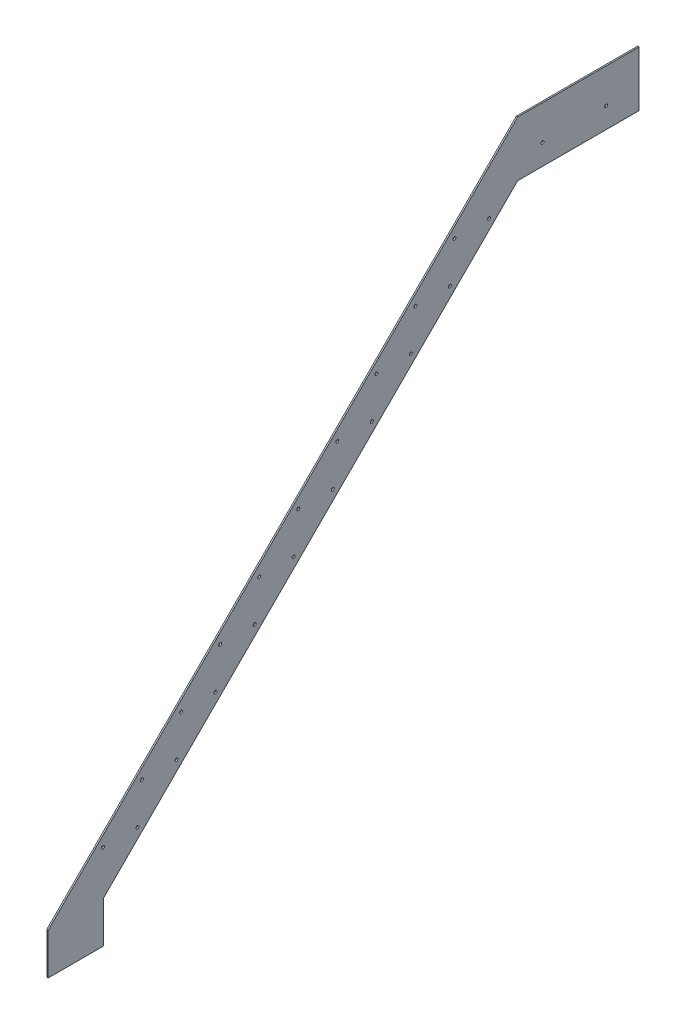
ISO-10303-21;
HEADER;
FILE_DESCRIPTION(('STEP AP214'),'2;1');
FILE_NAME('part.step','',(''),(''),'','','');
FILE_SCHEMA(('AUTOMOTIVE_DESIGN { 1 0 10303 214 1 1 1 1 }'));
ENDSEC;
DATA;
#1=APPLICATION_CONTEXT('core data for automotive mechanical design processes');
#2=APPLICATION_PROTOCOL_DEFINITION('international standard','automotive_design',2000,#1);
#3=PRODUCT_CONTEXT('',#1,'mechanical');
#4=PRODUCT('Part','Part','',(#3));
#5=PRODUCT_RELATED_PRODUCT_CATEGORY('part','',(#4));
#6=PRODUCT_DEFINITION_FORMATION('','',#4);
#7=PRODUCT_DEFINITION_CONTEXT('part definition',#1,'design');
#8=PRODUCT_DEFINITION('design','',#6,#7);
#9=PRODUCT_DEFINITION_SHAPE('','',#8);
#10=(LENGTH_UNIT() NAMED_UNIT(*) SI_UNIT(.MILLI.,.METRE.));
#11=(NAMED_UNIT(*) PLANE_ANGLE_UNIT() SI_UNIT($,.RADIAN.));
#12=(NAMED_UNIT(*) SI_UNIT($,.STERADIAN.) SOLID_ANGLE_UNIT());
#13=UNCERTAINTY_MEASURE_WITH_UNIT(LENGTH_MEASURE(1.E-05),#10,'distance_accuracy_value','');
#14=(GEOMETRIC_REPRESENTATION_CONTEXT(3) GLOBAL_UNCERTAINTY_ASSIGNED_CONTEXT((#13)) GLOBAL_UNIT_ASSIGNED_CONTEXT((#10,
#11,#12)) REPRESENTATION_CONTEXT('',''));
#15=CARTESIAN_POINT('',(0.,0.,0.));
#16=DIRECTION('',(0.,0.,1.));
#17=DIRECTION('',(1.,0.,0.));
#18=AXIS2_PLACEMENT_3D('',#15,#16,#17);
#19=CARTESIAN_POINT('',(0.,0.,0.));
#20=DIRECTION('',(-1.,0.,0.));
#21=DIRECTION('',(0.,0.,1.));
#22=AXIS2_PLACEMENT_3D('',#19,#20,#21);
#23=PLANE('',#22);
#24=CARTESIAN_POINT('',(0.,-1339.2135623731,1816.83920991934));
#25=DIRECTION('',(1.,0.,0.));
#26=DIRECTION('',(0.,0.,-1.));
#27=AXIS2_PLACEMENT_3D('',#24,#25,#26);
#28=CIRCLE('',#27,5.40000000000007);
#29=CARTESIAN_POINT('',(0.,-1339.2135623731,1811.43920991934));
#30=VERTEX_POINT('',#29);
#31=EDGE_CURVE('E287',#30,#30,#28,.T.);
#32=ORIENTED_EDGE('',*,*,#31,.F.);
#33=EDGE_LOOP('',(#32));
#34=FACE_BOUND('',#33,.T.);
#35=CARTESIAN_POINT('',(0.,-1197.79220613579,1675.41785368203));
#36=DIRECTION('',(1.,0.,0.));
#37=DIRECTION('',(0.,0.,-1.));
#38=AXIS2_PLACEMENT_3D('',#35,#36,#37);
#39=CIRCLE('',#38,5.40000000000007);
#40=CARTESIAN_POINT('',(0.,-1197.79220613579,1670.01785368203));
#41=VERTEX_POINT('',#40);
#42=EDGE_CURVE('E302',#41,#41,#39,.T.);
#43=ORIENTED_EDGE('',*,*,#42,.F.);
#44=EDGE_LOOP('',(#43));
#45=FACE_BOUND('',#44,.T.);
#46=CARTESIAN_POINT('',(0.,-1056.37084989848,1533.99649744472));
#47=DIRECTION('',(1.,0.,0.));
#48=DIRECTION('',(0.,0.,-1.));
#49=AXIS2_PLACEMENT_3D('',#46,#47,#48);
#50=CIRCLE('',#49,5.40000000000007);
#51=CARTESIAN_POINT('',(0.,-1056.37084989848,1528.59649744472));
#52=VERTEX_POINT('',#51);
#53=EDGE_CURVE('E314',#52,#52,#50,.T.);
#54=ORIENTED_EDGE('',*,*,#53,.F.);
#55=EDGE_LOOP('',(#54));
#56=FACE_BOUND('',#55,.T.);
#57=CARTESIAN_POINT('',(0.,-914.94949366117,1392.57514120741));
#58=DIRECTION('',(1.,0.,0.));
#59=DIRECTION('',(0.,0.,-1.));
#60=AXIS2_PLACEMENT_3D('',#57,#58,#59);
#61=CIRCLE('',#60,5.39999999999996);
#62=CARTESIAN_POINT('',(0.,-914.94949366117,1387.17514120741));
#63=VERTEX_POINT('',#62);
#64=EDGE_CURVE('E326',#63,#63,#61,.T.);
#65=ORIENTED_EDGE('',*,*,#64,.F.);
#66=EDGE_LOOP('',(#65));
#67=FACE_BOUND('',#66,.T.);
#68=CARTESIAN_POINT('',(0.,-773.52813742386,1251.1537849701));
#69=DIRECTION('',(1.,0.,0.));
#70=DIRECTION('',(0.,0.,-1.));
#71=AXIS2_PLACEMENT_3D('',#68,#69,#70);
#72=CIRCLE('',#71,5.39999999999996);
#73=CARTESIAN_POINT('',(0.,-773.52813742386,1245.7537849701));
#74=VERTEX_POINT('',#73);
#75=EDGE_CURVE('E338',#74,#74,#72,.T.);
#76=ORIENTED_EDGE('',*,*,#75,.F.);
#77=EDGE_LOOP('',(#76));
#78=FACE_BOUND('',#77,.T.);
#79=CARTESIAN_POINT('',(0.,-632.10678118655,1234.73242873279));
#80=DIRECTION('',(1.,0.,0.));
#81=DIRECTION('',(0.,0.,-1.));
#82=AXIS2_PLACEMENT_3D('',#79,#80,#81);
#83=CIRCLE('',#82,5.39999999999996);
#84=CARTESIAN_POINT('',(0.,-632.10678118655,1229.33242873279));
#85=VERTEX_POINT('',#84);
#86=EDGE_CURVE('E344',#85,#85,#83,.T.);
#87=ORIENTED_EDGE('',*,*,#86,.F.);
#88=EDGE_LOOP('',(#87));
#89=FACE_BOUND('',#88,.T.);
#90=CARTESIAN_POINT('',(0.,-490.68542494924,1093.31107249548));
#91=DIRECTION('',(1.,0.,0.));
#92=DIRECTION('',(0.,0.,-1.));
#93=AXIS2_PLACEMENT_3D('',#90,#91,#92);
#94=CIRCLE('',#93,5.39999999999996);
#95=CARTESIAN_POINT('',(0.,-490.68542494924,1087.91107249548));
#96=VERTEX_POINT('',#95);
#97=EDGE_CURVE('E356',#96,#96,#94,.T.);
#98=ORIENTED_EDGE('',*,*,#97,.F.);
#99=EDGE_LOOP('',(#98));
#100=FACE_BOUND('',#99,.T.);
#101=CARTESIAN_POINT('',(0.,-349.26406871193,951.889716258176));
#102=DIRECTION('',(1.,0.,0.));
#103=DIRECTION('',(0.,0.,-1.));
#104=AXIS2_PLACEMENT_3D('',#101,#102,#103);
#105=CIRCLE('',#104,5.40000000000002);
#106=CARTESIAN_POINT('',(0.,-349.26406871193,946.489716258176));
#107=VERTEX_POINT('',#106);
#108=EDGE_CURVE('E368',#107,#107,#105,.T.);
#109=ORIENTED_EDGE('',*,*,#108,.F.);
#110=EDGE_LOOP('',(#109));
#111=FACE_BOUND('',#110,.T.);
#112=CARTESIAN_POINT('',(0.,-207.84271247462,810.468360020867));
#113=DIRECTION('',(1.,0.,0.));
#114=DIRECTION('',(0.,0.,-1.));
#115=AXIS2_PLACEMENT_3D('',#112,#113,#114);
#116=CIRCLE('',#115,5.39999999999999);
#117=CARTESIAN_POINT('',(0.,-207.84271247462,805.068360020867));
#118=VERTEX_POINT('',#117);
#119=EDGE_CURVE('E380',#118,#118,#116,.T.);
#120=ORIENTED_EDGE('',*,*,#119,.F.);
#121=EDGE_LOOP('',(#120));
#122=FACE_BOUND('',#121,.T.);
#123=CARTESIAN_POINT('',(0.,-66.4213562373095,669.047003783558));
#124=DIRECTION('',(1.,0.,0.));
#125=DIRECTION('',(0.,0.,-1.));
#126=AXIS2_PLACEMENT_3D('',#123,#124,#125);
#127=CIRCLE('',#126,5.39999999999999);
#128=CARTESIAN_POINT('',(0.,-66.4213562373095,663.647003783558));
#129=VERTEX_POINT('',#128);
#130=EDGE_CURVE('E392',#129,#129,#127,.T.);
#131=ORIENTED_EDGE('',*,*,#130,.F.);
#132=EDGE_LOOP('',(#131));
#133=FACE_BOUND('',#132,.T.);
#134=DIRECTION('',(0.,1.,0.));
#135=VECTOR('',#134,1.);
#136=CARTESIAN_POINT('',(0.,200.,0.));
#137=LINE('',#136,#135);
#138=CARTESIAN_POINT('',(0.,0.,0.));
#139=VERTEX_POINT('',#138);
#140=CARTESIAN_POINT('',(0.,200.,0.));
#141=VERTEX_POINT('',#140);
#142=EDGE_CURVE('E139',#139,#141,#137,.T.);
#143=ORIENTED_EDGE('',*,*,#142,.T.);
#144=DIRECTION('',(0.,0.,1.));
#145=VECTOR('',#144,1.);
#146=CARTESIAN_POINT('',(0.,200.,440.12564754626));
#147=LINE('',#146,#145);
#148=CARTESIAN_POINT('',(0.,200.,440.12564754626));
#149=VERTEX_POINT('',#148);
#150=EDGE_CURVE('E142',#141,#149,#147,.T.);
#151=ORIENTED_EDGE('',*,*,#150,.T.);
#152=DIRECTION('',(0.,-0.70710678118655,0.707106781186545));
#153=VECTOR('',#152,1.);
#154=CARTESIAN_POINT('',(0.,-1500.,2140.12564754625));
#155=LINE('',#154,#153);
#156=CARTESIAN_POINT('',(0.,-1500.,2140.12564754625));
#157=VERTEX_POINT('',#156);
#158=EDGE_CURVE('E146',#149,#157,#155,.T.);
#159=ORIENTED_EDGE('',*,*,#158,.T.);
#160=DIRECTION('',(0.,-1.,0.));
#161=VECTOR('',#160,1.);
#162=CARTESIAN_POINT('',(0.,-1650.,2140.12564754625));
#163=LINE('',#162,#161);
#164=CARTESIAN_POINT('',(0.,-1650.,2140.12564754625));
#165=VERTEX_POINT('',#164);
#166=EDGE_CURVE('E149',#157,#165,#163,.T.);
#167=ORIENTED_EDGE('',*,*,#166,.T.);
#168=DIRECTION('',(0.,0.,-1.));
#169=VECTOR('',#168,1.);
#170=CARTESIAN_POINT('',(0.,-1650.,1940.12564754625));
#171=LINE('',#170,#169);
#172=CARTESIAN_POINT('',(0.,-1650.,1940.12564754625));
#173=VERTEX_POINT('',#172);
#174=EDGE_CURVE('E152',#165,#173,#171,.T.);
#175=ORIENTED_EDGE('',*,*,#174,.T.);
#176=DIRECTION('',(0.,1.,0.));
#177=VECTOR('',#176,1.);
#178=CARTESIAN_POINT('',(0.,-1500.,1940.12564754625));
#179=LINE('',#178,#177);
#180=CARTESIAN_POINT('',(0.,-1500.,1940.12564754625));
#181=VERTEX_POINT('',#180);
#182=EDGE_CURVE('E155',#173,#181,#179,.T.);
#183=ORIENTED_EDGE('',*,*,#182,.T.);
#184=DIRECTION('',(0.,0.70710678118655,-0.707106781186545));
#185=VECTOR('',#184,1.);
#186=CARTESIAN_POINT('',(0.,0.,440.12564754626));
#187=LINE('',#186,#185);
#188=CARTESIAN_POINT('',(0.,0.,440.12564754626));
#189=VERTEX_POINT('',#188);
#190=EDGE_CURVE('E116',#181,#189,#187,.T.);
#191=ORIENTED_EDGE('',*,*,#190,.T.);
#192=DIRECTION('',(0.,0.,-1.));
#193=VECTOR('',#192,1.);
#194=CARTESIAN_POINT('',(0.,0.,0.));
#195=LINE('',#194,#193);
#196=EDGE_CURVE('E158',#189,#139,#195,.T.);
#197=ORIENTED_EDGE('',*,*,#196,.T.);
#198=EDGE_LOOP('',(#143,#151,#159,#167,#175,#183,#191,#197));
#199=FACE_BOUND('',#198,.T.);
#200=CARTESIAN_POINT('',(0.,75.,350.));
#201=DIRECTION('',(1.,0.,0.));
#202=DIRECTION('',(0.,0.,-1.));
#203=AXIS2_PLACEMENT_3D('',#200,#201,#202);
#204=CIRCLE('',#203,5.39999999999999);
#205=CARTESIAN_POINT('',(0.,75.,344.6));
#206=VERTEX_POINT('',#205);
#207=EDGE_CURVE('E410',#206,#206,#204,.T.);
#208=ORIENTED_EDGE('',*,*,#207,.F.);
#209=EDGE_LOOP('',(#208));
#210=FACE_BOUND('',#209,.T.);
#211=CARTESIAN_POINT('',(0.,75.,120.));
#212=DIRECTION('',(1.,0.,0.));
#213=DIRECTION('',(0.,0.,-1.));
#214=AXIS2_PLACEMENT_3D('',#211,#212,#213);
#215=CIRCLE('',#214,5.39999999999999);
#216=CARTESIAN_POINT('',(0.,75.,114.6));
#217=VERTEX_POINT('',#216);
#218=EDGE_CURVE('E404',#217,#217,#215,.T.);
#219=ORIENTED_EDGE('',*,*,#218,.F.);
#220=EDGE_LOOP('',(#219));
#221=FACE_BOUND('',#220,.T.);
#222=CARTESIAN_POINT('',(0.,-66.4213562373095,544.047003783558));
#223=DIRECTION('',(1.,0.,0.));
#224=DIRECTION('',(0.,0.,-1.));
#225=AXIS2_PLACEMENT_3D('',#222,#223,#224);
#226=CIRCLE('',#225,5.39999999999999);
#227=CARTESIAN_POINT('',(0.,-66.4213562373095,538.647003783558));
#228=VERTEX_POINT('',#227);
#229=EDGE_CURVE('E398',#228,#228,#226,.T.);
#230=ORIENTED_EDGE('',*,*,#229,.F.);
#231=EDGE_LOOP('',(#230));
#232=FACE_BOUND('',#231,.T.);
#233=CARTESIAN_POINT('',(0.,-207.84271247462,685.468360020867));
#234=DIRECTION('',(1.,0.,0.));
#235=DIRECTION('',(0.,0.,-1.));
#236=AXIS2_PLACEMENT_3D('',#233,#234,#235);
#237=CIRCLE('',#236,5.39999999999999);
#238=CARTESIAN_POINT('',(0.,-207.84271247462,680.068360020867));
#239=VERTEX_POINT('',#238);
#240=EDGE_CURVE('E386',#239,#239,#237,.T.);
#241=ORIENTED_EDGE('',*,*,#240,.F.);
#242=EDGE_LOOP('',(#241));
#243=FACE_BOUND('',#242,.T.);
#244=CARTESIAN_POINT('',(0.,-349.264068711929,826.889716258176));
#245=DIRECTION('',(1.,0.,0.));
#246=DIRECTION('',(0.,0.,-1.));
#247=AXIS2_PLACEMENT_3D('',#244,#245,#246);
#248=CIRCLE('',#247,5.39999999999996);
#249=CARTESIAN_POINT('',(0.,-349.264068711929,821.489716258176));
#250=VERTEX_POINT('',#249);
#251=EDGE_CURVE('E374',#250,#250,#248,.T.);
#252=ORIENTED_EDGE('',*,*,#251,.F.);
#253=EDGE_LOOP('',(#252));
#254=FACE_BOUND('',#253,.T.);
#255=CARTESIAN_POINT('',(0.,-490.68542494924,968.311072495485));
#256=DIRECTION('',(1.,0.,0.));
#257=DIRECTION('',(0.,0.,-1.));
#258=AXIS2_PLACEMENT_3D('',#255,#256,#257);
#259=CIRCLE('',#258,5.39999999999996);
#260=CARTESIAN_POINT('',(0.,-490.68542494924,962.911072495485));
#261=VERTEX_POINT('',#260);
#262=EDGE_CURVE('E362',#261,#261,#259,.T.);
#263=ORIENTED_EDGE('',*,*,#262,.F.);
#264=EDGE_LOOP('',(#263));
#265=FACE_BOUND('',#264,.T.);
#266=CARTESIAN_POINT('',(0.,-632.10678118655,1109.73242873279));
#267=DIRECTION('',(1.,0.,0.));
#268=DIRECTION('',(0.,0.,-1.));
#269=AXIS2_PLACEMENT_3D('',#266,#267,#268);
#270=CIRCLE('',#269,5.39999999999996);
#271=CARTESIAN_POINT('',(0.,-632.10678118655,1104.33242873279));
#272=VERTEX_POINT('',#271);
#273=EDGE_CURVE('E350',#272,#272,#270,.T.);
#274=ORIENTED_EDGE('',*,*,#273,.F.);
#275=EDGE_LOOP('',(#274));
#276=FACE_BOUND('',#275,.T.);
#277=CARTESIAN_POINT('',(0.,-773.52813742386,1376.1537849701));
#278=DIRECTION('',(1.,0.,0.));
#279=DIRECTION('',(0.,0.,-1.));
#280=AXIS2_PLACEMENT_3D('',#277,#278,#279);
#281=CIRCLE('',#280,5.39999999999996);
#282=CARTESIAN_POINT('',(0.,-773.52813742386,1370.7537849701));
#283=VERTEX_POINT('',#282);
#284=EDGE_CURVE('E332',#283,#283,#281,.T.);
#285=ORIENTED_EDGE('',*,*,#284,.F.);
#286=EDGE_LOOP('',(#285));
#287=FACE_BOUND('',#286,.T.);
#288=CARTESIAN_POINT('',(0.,-914.94949366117,1517.57514120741));
#289=DIRECTION('',(1.,0.,0.));
#290=DIRECTION('',(0.,0.,-1.));
#291=AXIS2_PLACEMENT_3D('',#288,#289,#290);
#292=CIRCLE('',#291,5.39999999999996);
#293=CARTESIAN_POINT('',(0.,-914.94949366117,1512.17514120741));
#294=VERTEX_POINT('',#293);
#295=EDGE_CURVE('E320',#294,#294,#292,.T.);
#296=ORIENTED_EDGE('',*,*,#295,.F.);
#297=EDGE_LOOP('',(#296));
#298=FACE_BOUND('',#297,.T.);
#299=CARTESIAN_POINT('',(0.,-1056.37084989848,1658.99649744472));
#300=DIRECTION('',(1.,0.,0.));
#301=DIRECTION('',(0.,0.,-1.));
#302=AXIS2_PLACEMENT_3D('',#299,#300,#301);
#303=CIRCLE('',#302,5.40000000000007);
#304=CARTESIAN_POINT('',(0.,-1056.37084989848,1653.59649744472));
#305=VERTEX_POINT('',#304);
#306=EDGE_CURVE('E308',#305,#305,#303,.T.);
#307=ORIENTED_EDGE('',*,*,#306,.F.);
#308=EDGE_LOOP('',(#307));
#309=FACE_BOUND('',#308,.T.);
#310=CARTESIAN_POINT('',(0.,-1197.79220613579,1800.41785368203));
#311=DIRECTION('',(1.,0.,0.));
#312=DIRECTION('',(0.,0.,-1.));
#313=AXIS2_PLACEMENT_3D('',#310,#311,#312);
#314=CIRCLE('',#313,5.40000000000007);
#315=CARTESIAN_POINT('',(0.,-1197.79220613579,1795.01785368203));
#316=VERTEX_POINT('',#315);
#317=EDGE_CURVE('E296',#316,#316,#314,.T.);
#318=ORIENTED_EDGE('',*,*,#317,.F.);
#319=EDGE_LOOP('',(#318));
#320=FACE_BOUND('',#319,.T.);
#321=CARTESIAN_POINT('',(0.,-1339.2135623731,1941.83920991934));
#322=DIRECTION('',(1.,0.,0.));
#323=DIRECTION('',(0.,0.,-1.));
#324=AXIS2_PLACEMENT_3D('',#321,#322,#323);
#325=CIRCLE('',#324,5.40000000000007);
#326=CARTESIAN_POINT('',(0.,-1339.2135623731,1936.43920991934));
#327=VERTEX_POINT('',#326);
#328=EDGE_CURVE('E283',#327,#327,#325,.T.);
#329=ORIENTED_EDGE('',*,*,#328,.F.);
#330=EDGE_LOOP('',(#329));
#331=FACE_BOUND('',#330,.T.);
#332=ADVANCED_FACE('F41',(#34,#45,#56,#67,#78,#89,#100,#111,#122,#133,#199,#210,#221,#232,#243,
#254,#265,#276,#287,#298,#309,#320,#331),#23,.F.);
#333=CARTESIAN_POINT('',(-5.,200.,0.));
#334=DIRECTION('',(0.,0.,-1.));
#335=DIRECTION('',(-1.,0.,0.));
#336=AXIS2_PLACEMENT_3D('',#333,#334,#335);
#337=PLANE('',#336);
#338=ORIENTED_EDGE('',*,*,#142,.F.);
#339=DIRECTION('',(1.,0.,0.));
#340=VECTOR('',#339,1.);
#341=CARTESIAN_POINT('',(-5.,0.,0.));
#342=LINE('',#341,#340);
#343=CARTESIAN_POINT('',(-5.,0.,0.));
#344=VERTEX_POINT('',#343);
#345=EDGE_CURVE('E11',#344,#139,#342,.T.);
#346=ORIENTED_EDGE('',*,*,#345,.F.);
#347=DIRECTION('',(0.,1.,0.));
#348=VECTOR('',#347,1.);
#349=CARTESIAN_POINT('',(-5.,200.,0.));
#350=LINE('',#349,#348);
#351=CARTESIAN_POINT('',(-5.,200.,0.));
#352=VERTEX_POINT('',#351);
#353=EDGE_CURVE('E160',#344,#352,#350,.T.);
#354=ORIENTED_EDGE('',*,*,#353,.T.);
#355=DIRECTION('',(1.,0.,0.));
#356=VECTOR('',#355,1.);
#357=CARTESIAN_POINT('',(-5.,200.,0.));
#358=LINE('',#357,#356);
#359=EDGE_CURVE('E45',#352,#141,#358,.T.);
#360=ORIENTED_EDGE('',*,*,#359,.T.);
#361=EDGE_LOOP('',(#338,#346,#354,#360));
#362=FACE_BOUND('',#361,.T.);
#363=ADVANCED_FACE('F43',(#362),#337,.T.);
#364=CARTESIAN_POINT('',(-5.,0.,0.));
#365=DIRECTION('',(0.,-1.,0.));
#366=DIRECTION('',(0.,0.,-1.));
#367=AXIS2_PLACEMENT_3D('',#364,#365,#366);
#368=PLANE('',#367);
#369=ORIENTED_EDGE('',*,*,#196,.F.);
#370=DIRECTION('',(1.,0.,0.));
#371=VECTOR('',#370,1.);
#372=CARTESIAN_POINT('',(-5.,0.,440.12564754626));
#373=LINE('',#372,#371);
#374=CARTESIAN_POINT('',(-5.,0.,440.12564754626));
#375=VERTEX_POINT('',#374);
#376=EDGE_CURVE('E51',#375,#189,#373,.T.);
#377=ORIENTED_EDGE('',*,*,#376,.F.);
#378=DIRECTION('',(0.,0.,-1.));
#379=VECTOR('',#378,1.);
#380=CARTESIAN_POINT('',(-5.,0.,0.));
#381=LINE('',#380,#379);
#382=EDGE_CURVE('E129',#375,#344,#381,.T.);
#383=ORIENTED_EDGE('',*,*,#382,.T.);
#384=ORIENTED_EDGE('',*,*,#345,.T.);
#385=EDGE_LOOP('',(#369,#377,#383,#384));
#386=FACE_BOUND('',#385,.T.);
#387=ADVANCED_FACE('F172',(#386),#368,.T.);
#388=CARTESIAN_POINT('',(-5.,0.,440.12564754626));
#389=DIRECTION('',(0.,-0.707106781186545,-0.70710678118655));
#390=DIRECTION('',(0.,0.70710678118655,-0.707106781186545));
#391=AXIS2_PLACEMENT_3D('',#388,#389,#390);
#392=PLANE('',#391);
#393=ORIENTED_EDGE('',*,*,#190,.F.);
#394=DIRECTION('',(1.,0.,0.));
#395=VECTOR('',#394,1.);
#396=CARTESIAN_POINT('',(-5.,-1500.,1940.12564754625));
#397=LINE('',#396,#395);
#398=CARTESIAN_POINT('',(-5.,-1500.,1940.12564754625));
#399=VERTEX_POINT('',#398);
#400=EDGE_CURVE('E111',#399,#181,#397,.T.);
#401=ORIENTED_EDGE('',*,*,#400,.F.);
#402=DIRECTION('',(0.,0.70710678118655,-0.707106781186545));
#403=VECTOR('',#402,1.);
#404=CARTESIAN_POINT('',(-5.,0.,440.12564754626));
#405=LINE('',#404,#403);
#406=EDGE_CURVE('E114',#399,#375,#405,.T.);
#407=ORIENTED_EDGE('',*,*,#406,.T.);
#408=ORIENTED_EDGE('',*,*,#376,.T.);
#409=EDGE_LOOP('',(#393,#401,#407,#408));
#410=FACE_BOUND('',#409,.T.);
#411=ADVANCED_FACE('F113',(#410),#392,.T.);
#412=CARTESIAN_POINT('',(-5.,-1500.,1940.12564754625));
#413=DIRECTION('',(0.,0.,-1.));
#414=DIRECTION('',(0.,1.,0.));
#415=AXIS2_PLACEMENT_3D('',#412,#413,#414);
#416=PLANE('',#415);
#417=ORIENTED_EDGE('',*,*,#182,.F.);
#418=DIRECTION('',(1.,0.,0.));
#419=VECTOR('',#418,1.);
#420=CARTESIAN_POINT('',(-5.,-1650.,1940.12564754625));
#421=LINE('',#420,#419);
#422=CARTESIAN_POINT('',(-5.,-1650.,1940.12564754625));
#423=VERTEX_POINT('',#422);
#424=EDGE_CURVE('E121',#423,#173,#421,.T.);
#425=ORIENTED_EDGE('',*,*,#424,.F.);
#426=DIRECTION('',(0.,1.,0.));
#427=VECTOR('',#426,1.);
#428=CARTESIAN_POINT('',(-5.,-1500.,1940.12564754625));
#429=LINE('',#428,#427);
#430=EDGE_CURVE('E127',#423,#399,#429,.T.);
#431=ORIENTED_EDGE('',*,*,#430,.T.);
#432=ORIENTED_EDGE('',*,*,#400,.T.);
#433=EDGE_LOOP('',(#417,#425,#431,#432));
#434=FACE_BOUND('',#433,.T.);
#435=ADVANCED_FACE('F131',(#434),#416,.T.);
#436=CARTESIAN_POINT('',(-5.,-1650.,1940.12564754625));
#437=DIRECTION('',(0.,-1.,0.));
#438=DIRECTION('',(0.,0.,-1.));
#439=AXIS2_PLACEMENT_3D('',#436,#437,#438);
#440=PLANE('',#439);
#441=ORIENTED_EDGE('',*,*,#174,.F.);
#442=DIRECTION('',(1.,0.,0.));
#443=VECTOR('',#442,1.);
#444=CARTESIAN_POINT('',(-5.,-1650.,2140.12564754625));
#445=LINE('',#444,#443);
#446=CARTESIAN_POINT('',(-5.,-1650.,2140.12564754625));
#447=VERTEX_POINT('',#446);
#448=EDGE_CURVE('E164',#447,#165,#445,.T.);
#449=ORIENTED_EDGE('',*,*,#448,.F.);
#450=DIRECTION('',(0.,0.,-1.));
#451=VECTOR('',#450,1.);
#452=CARTESIAN_POINT('',(-5.,-1650.,1940.12564754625));
#453=LINE('',#452,#451);
#454=EDGE_CURVE('E132',#447,#423,#453,.T.);
#455=ORIENTED_EDGE('',*,*,#454,.T.);
#456=ORIENTED_EDGE('',*,*,#424,.T.);
#457=EDGE_LOOP('',(#441,#449,#455,#456));
#458=FACE_BOUND('',#457,.T.);
#459=ADVANCED_FACE('F430',(#458),#440,.T.);
#460=CARTESIAN_POINT('',(-5.,-1650.,2140.12564754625));
#461=DIRECTION('',(0.,0.,1.));
#462=DIRECTION('',(0.,-1.,0.));
#463=AXIS2_PLACEMENT_3D('',#460,#461,#462);
#464=PLANE('',#463);
#465=ORIENTED_EDGE('',*,*,#166,.F.);
#466=DIRECTION('',(1.,0.,0.));
#467=VECTOR('',#466,1.);
#468=CARTESIAN_POINT('',(-5.,-1500.,2140.12564754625));
#469=LINE('',#468,#467);
#470=CARTESIAN_POINT('',(-5.,-1500.,2140.12564754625));
#471=VERTEX_POINT('',#470);
#472=EDGE_CURVE('E166',#471,#157,#469,.T.);
#473=ORIENTED_EDGE('',*,*,#472,.F.);
#474=DIRECTION('',(0.,-1.,0.));
#475=VECTOR('',#474,1.);
#476=CARTESIAN_POINT('',(-5.,-1650.,2140.12564754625));
#477=LINE('',#476,#475);
#478=EDGE_CURVE('E134',#471,#447,#477,.T.);
#479=ORIENTED_EDGE('',*,*,#478,.T.);
#480=ORIENTED_EDGE('',*,*,#448,.T.);
#481=EDGE_LOOP('',(#465,#473,#479,#480));
#482=FACE_BOUND('',#481,.T.);
#483=ADVANCED_FACE('F424',(#482),#464,.T.);
#484=CARTESIAN_POINT('',(-5.,-1500.,2140.12564754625));
#485=DIRECTION('',(0.,0.707106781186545,0.70710678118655));
#486=DIRECTION('',(0.,-0.70710678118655,0.707106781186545));
#487=AXIS2_PLACEMENT_3D('',#484,#485,#486);
#488=PLANE('',#487);
#489=ORIENTED_EDGE('',*,*,#158,.F.);
#490=DIRECTION('',(1.,0.,0.));
#491=VECTOR('',#490,1.);
#492=CARTESIAN_POINT('',(-5.,200.,440.12564754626));
#493=LINE('',#492,#491);
#494=CARTESIAN_POINT('',(-5.,200.,440.12564754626));
#495=VERTEX_POINT('',#494);
#496=EDGE_CURVE('E167',#495,#149,#493,.T.);
#497=ORIENTED_EDGE('',*,*,#496,.F.);
#498=DIRECTION('',(0.,-0.70710678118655,0.707106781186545));
#499=VECTOR('',#498,1.);
#500=CARTESIAN_POINT('',(-5.,-1500.,2140.12564754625));
#501=LINE('',#500,#499);
#502=EDGE_CURVE('E418',#495,#471,#501,.T.);
#503=ORIENTED_EDGE('',*,*,#502,.T.);
#504=ORIENTED_EDGE('',*,*,#472,.T.);
#505=EDGE_LOOP('',(#489,#497,#503,#504));
#506=FACE_BOUND('',#505,.T.);
#507=ADVANCED_FACE('F428',(#506),#488,.T.);
#508=CARTESIAN_POINT('',(-5.,200.,440.12564754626));
#509=DIRECTION('',(0.,1.,0.));
#510=DIRECTION('',(0.,0.,1.));
#511=AXIS2_PLACEMENT_3D('',#508,#509,#510);
#512=PLANE('',#511);
#513=ORIENTED_EDGE('',*,*,#150,.F.);
#514=ORIENTED_EDGE('',*,*,#359,.F.);
#515=DIRECTION('',(0.,0.,1.));
#516=VECTOR('',#515,1.);
#517=CARTESIAN_POINT('',(-5.,200.,440.12564754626));
#518=LINE('',#517,#516);
#519=EDGE_CURVE('E416',#352,#495,#518,.T.);
#520=ORIENTED_EDGE('',*,*,#519,.T.);
#521=ORIENTED_EDGE('',*,*,#496,.T.);
#522=EDGE_LOOP('',(#513,#514,#520,#521));
#523=FACE_BOUND('',#522,.T.);
#524=ADVANCED_FACE('F169',(#523),#512,.T.);
#525=CARTESIAN_POINT('',(-5.,0.,0.));
#526=DIRECTION('',(-1.,0.,0.));
#527=DIRECTION('',(0.,0.,1.));
#528=AXIS2_PLACEMENT_3D('',#525,#526,#527);
#529=PLANE('',#528);
#530=CARTESIAN_POINT('',(-5.,-1339.2135623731,1941.83920991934));
#531=DIRECTION('',(-1.,0.,0.));
#532=DIRECTION('',(0.,0.,1.));
#533=AXIS2_PLACEMENT_3D('',#530,#531,#532);
#534=CIRCLE('',#533,5.40000000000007);
#535=CARTESIAN_POINT('',(-5.,-1339.2135623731,1947.23920991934));
#536=VERTEX_POINT('',#535);
#537=EDGE_CURVE('E286',#536,#536,#534,.T.);
#538=ORIENTED_EDGE('',*,*,#537,.F.);
#539=EDGE_LOOP('',(#538));
#540=FACE_BOUND('',#539,.T.);
#541=CARTESIAN_POINT('',(-5.,-1339.2135623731,1816.83920991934));
#542=DIRECTION('',(-1.,0.,0.));
#543=DIRECTION('',(0.,0.,1.));
#544=AXIS2_PLACEMENT_3D('',#541,#542,#543);
#545=CIRCLE('',#544,5.40000000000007);
#546=CARTESIAN_POINT('',(-5.,-1339.2135623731,1822.23920991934));
#547=VERTEX_POINT('',#546);
#548=EDGE_CURVE('E290',#547,#547,#545,.T.);
#549=ORIENTED_EDGE('',*,*,#548,.F.);
#550=EDGE_LOOP('',(#549));
#551=FACE_BOUND('',#550,.T.);
#552=CARTESIAN_POINT('',(-5.,-1197.79220613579,1800.41785368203));
#553=DIRECTION('',(-1.,0.,0.));
#554=DIRECTION('',(0.,0.,1.));
#555=AXIS2_PLACEMENT_3D('',#552,#553,#554);
#556=CIRCLE('',#555,5.40000000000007);
#557=CARTESIAN_POINT('',(-5.,-1197.79220613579,1805.81785368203));
#558=VERTEX_POINT('',#557);
#559=EDGE_CURVE('E299',#558,#558,#556,.T.);
#560=ORIENTED_EDGE('',*,*,#559,.F.);
#561=EDGE_LOOP('',(#560));
#562=FACE_BOUND('',#561,.T.);
#563=CARTESIAN_POINT('',(-5.,-1197.79220613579,1675.41785368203));
#564=DIRECTION('',(-1.,0.,0.));
#565=DIRECTION('',(0.,0.,1.));
#566=AXIS2_PLACEMENT_3D('',#563,#564,#565);
#567=CIRCLE('',#566,5.40000000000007);
#568=CARTESIAN_POINT('',(-5.,-1197.79220613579,1680.81785368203));
#569=VERTEX_POINT('',#568);
#570=EDGE_CURVE('E305',#569,#569,#567,.T.);
#571=ORIENTED_EDGE('',*,*,#570,.F.);
#572=EDGE_LOOP('',(#571));
#573=FACE_BOUND('',#572,.T.);
#574=CARTESIAN_POINT('',(-5.,-1056.37084989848,1658.99649744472));
#575=DIRECTION('',(-1.,0.,0.));
#576=DIRECTION('',(0.,0.,1.));
#577=AXIS2_PLACEMENT_3D('',#574,#575,#576);
#578=CIRCLE('',#577,5.40000000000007);
#579=CARTESIAN_POINT('',(-5.,-1056.37084989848,1664.39649744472));
#580=VERTEX_POINT('',#579);
#581=EDGE_CURVE('E311',#580,#580,#578,.T.);
#582=ORIENTED_EDGE('',*,*,#581,.F.);
#583=EDGE_LOOP('',(#582));
#584=FACE_BOUND('',#583,.T.);
#585=CARTESIAN_POINT('',(-5.,-1056.37084989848,1533.99649744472));
#586=DIRECTION('',(-1.,0.,0.));
#587=DIRECTION('',(0.,0.,1.));
#588=AXIS2_PLACEMENT_3D('',#585,#586,#587);
#589=CIRCLE('',#588,5.40000000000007);
#590=CARTESIAN_POINT('',(-5.,-1056.37084989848,1539.39649744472));
#591=VERTEX_POINT('',#590);
#592=EDGE_CURVE('E317',#591,#591,#589,.T.);
#593=ORIENTED_EDGE('',*,*,#592,.F.);
#594=EDGE_LOOP('',(#593));
#595=FACE_BOUND('',#594,.T.);
#596=CARTESIAN_POINT('',(-5.,-914.94949366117,1517.57514120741));
#597=DIRECTION('',(-1.,0.,0.));
#598=DIRECTION('',(0.,0.,1.));
#599=AXIS2_PLACEMENT_3D('',#596,#597,#598);
#600=CIRCLE('',#599,5.39999999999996);
#601=CARTESIAN_POINT('',(-5.,-914.94949366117,1522.97514120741));
#602=VERTEX_POINT('',#601);
#603=EDGE_CURVE('E323',#602,#602,#600,.T.);
#604=ORIENTED_EDGE('',*,*,#603,.F.);
#605=EDGE_LOOP('',(#604));
#606=FACE_BOUND('',#605,.T.);
#607=CARTESIAN_POINT('',(-5.,-914.94949366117,1392.57514120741));
#608=DIRECTION('',(-1.,0.,0.));
#609=DIRECTION('',(0.,0.,1.));
#610=AXIS2_PLACEMENT_3D('',#607,#608,#609);
#611=CIRCLE('',#610,5.39999999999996);
#612=CARTESIAN_POINT('',(-5.,-914.94949366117,1397.97514120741));
#613=VERTEX_POINT('',#612);
#614=EDGE_CURVE('E329',#613,#613,#611,.T.);
#615=ORIENTED_EDGE('',*,*,#614,.F.);
#616=EDGE_LOOP('',(#615));
#617=FACE_BOUND('',#616,.T.);
#618=CARTESIAN_POINT('',(-5.,-773.52813742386,1376.1537849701));
#619=DIRECTION('',(-1.,0.,0.));
#620=DIRECTION('',(0.,0.,1.));
#621=AXIS2_PLACEMENT_3D('',#618,#619,#620);
#622=CIRCLE('',#621,5.39999999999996);
#623=CARTESIAN_POINT('',(-5.,-773.52813742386,1381.5537849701));
#624=VERTEX_POINT('',#623);
#625=EDGE_CURVE('E335',#624,#624,#622,.T.);
#626=ORIENTED_EDGE('',*,*,#625,.F.);
#627=EDGE_LOOP('',(#626));
#628=FACE_BOUND('',#627,.T.);
#629=CARTESIAN_POINT('',(-5.,-773.52813742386,1251.1537849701));
#630=DIRECTION('',(-1.,0.,0.));
#631=DIRECTION('',(0.,0.,1.));
#632=AXIS2_PLACEMENT_3D('',#629,#630,#631);
#633=CIRCLE('',#632,5.39999999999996);
#634=CARTESIAN_POINT('',(-5.,-773.52813742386,1256.5537849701));
#635=VERTEX_POINT('',#634);
#636=EDGE_CURVE('E341',#635,#635,#633,.T.);
#637=ORIENTED_EDGE('',*,*,#636,.F.);
#638=EDGE_LOOP('',(#637));
#639=FACE_BOUND('',#638,.T.);
#640=CARTESIAN_POINT('',(-5.,-632.10678118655,1234.73242873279));
#641=DIRECTION('',(-1.,0.,0.));
#642=DIRECTION('',(0.,0.,1.));
#643=AXIS2_PLACEMENT_3D('',#640,#641,#642);
#644=CIRCLE('',#643,5.39999999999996);
#645=CARTESIAN_POINT('',(-5.,-632.10678118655,1240.13242873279));
#646=VERTEX_POINT('',#645);
#647=EDGE_CURVE('E347',#646,#646,#644,.T.);
#648=ORIENTED_EDGE('',*,*,#647,.F.);
#649=EDGE_LOOP('',(#648));
#650=FACE_BOUND('',#649,.T.);
#651=CARTESIAN_POINT('',(-5.,-632.10678118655,1109.73242873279));
#652=DIRECTION('',(-1.,0.,0.));
#653=DIRECTION('',(0.,0.,1.));
#654=AXIS2_PLACEMENT_3D('',#651,#652,#653);
#655=CIRCLE('',#654,5.39999999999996);
#656=CARTESIAN_POINT('',(-5.,-632.10678118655,1115.13242873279));
#657=VERTEX_POINT('',#656);
#658=EDGE_CURVE('E353',#657,#657,#655,.T.);
#659=ORIENTED_EDGE('',*,*,#658,.F.);
#660=EDGE_LOOP('',(#659));
#661=FACE_BOUND('',#660,.T.);
#662=CARTESIAN_POINT('',(-5.,-490.68542494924,1093.31107249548));
#663=DIRECTION('',(-1.,0.,0.));
#664=DIRECTION('',(0.,0.,1.));
#665=AXIS2_PLACEMENT_3D('',#662,#663,#664);
#666=CIRCLE('',#665,5.39999999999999);
#667=CARTESIAN_POINT('',(-5.,-490.68542494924,1098.71107249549));
#668=VERTEX_POINT('',#667);
#669=EDGE_CURVE('E359',#668,#668,#666,.T.);
#670=ORIENTED_EDGE('',*,*,#669,.F.);
#671=EDGE_LOOP('',(#670));
#672=FACE_BOUND('',#671,.T.);
#673=CARTESIAN_POINT('',(-5.,-490.68542494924,968.311072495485));
#674=DIRECTION('',(-1.,0.,0.));
#675=DIRECTION('',(0.,0.,1.));
#676=AXIS2_PLACEMENT_3D('',#673,#674,#675);
#677=CIRCLE('',#676,5.39999999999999);
#678=CARTESIAN_POINT('',(-5.,-490.68542494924,973.711072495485));
#679=VERTEX_POINT('',#678);
#680=EDGE_CURVE('E365',#679,#679,#677,.T.);
#681=ORIENTED_EDGE('',*,*,#680,.F.);
#682=EDGE_LOOP('',(#681));
#683=FACE_BOUND('',#682,.T.);
#684=CARTESIAN_POINT('',(-5.,-349.26406871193,951.889716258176));
#685=DIRECTION('',(-1.,0.,0.));
#686=DIRECTION('',(0.,0.,1.));
#687=AXIS2_PLACEMENT_3D('',#684,#685,#686);
#688=CIRCLE('',#687,5.40000000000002);
#689=CARTESIAN_POINT('',(-5.,-349.26406871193,957.289716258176));
#690=VERTEX_POINT('',#689);
#691=EDGE_CURVE('E371',#690,#690,#688,.T.);
#692=ORIENTED_EDGE('',*,*,#691,.F.);
#693=EDGE_LOOP('',(#692));
#694=FACE_BOUND('',#693,.T.);
#695=CARTESIAN_POINT('',(-5.,-349.264068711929,826.889716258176));
#696=DIRECTION('',(-1.,0.,0.));
#697=DIRECTION('',(0.,0.,1.));
#698=AXIS2_PLACEMENT_3D('',#695,#696,#697);
#699=CIRCLE('',#698,5.39999999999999);
#700=CARTESIAN_POINT('',(-5.,-349.264068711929,832.289716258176));
#701=VERTEX_POINT('',#700);
#702=EDGE_CURVE('E377',#701,#701,#699,.T.);
#703=ORIENTED_EDGE('',*,*,#702,.F.);
#704=EDGE_LOOP('',(#703));
#705=FACE_BOUND('',#704,.T.);
#706=CARTESIAN_POINT('',(-5.,-207.84271247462,810.468360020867));
#707=DIRECTION('',(-1.,0.,0.));
#708=DIRECTION('',(0.,0.,1.));
#709=AXIS2_PLACEMENT_3D('',#706,#707,#708);
#710=CIRCLE('',#709,5.39999999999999);
#711=CARTESIAN_POINT('',(-5.,-207.84271247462,815.868360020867));
#712=VERTEX_POINT('',#711);
#713=EDGE_CURVE('E383',#712,#712,#710,.T.);
#714=ORIENTED_EDGE('',*,*,#713,.F.);
#715=EDGE_LOOP('',(#714));
#716=FACE_BOUND('',#715,.T.);
#717=CARTESIAN_POINT('',(-5.,-207.84271247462,685.468360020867));
#718=DIRECTION('',(-1.,0.,0.));
#719=DIRECTION('',(0.,0.,1.));
#720=AXIS2_PLACEMENT_3D('',#717,#718,#719);
#721=CIRCLE('',#720,5.39999999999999);
#722=CARTESIAN_POINT('',(-5.,-207.84271247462,690.868360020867));
#723=VERTEX_POINT('',#722);
#724=EDGE_CURVE('E389',#723,#723,#721,.T.);
#725=ORIENTED_EDGE('',*,*,#724,.F.);
#726=EDGE_LOOP('',(#725));
#727=FACE_BOUND('',#726,.T.);
#728=CARTESIAN_POINT('',(-5.,-66.4213562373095,669.047003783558));
#729=DIRECTION('',(-1.,0.,0.));
#730=DIRECTION('',(0.,0.,1.));
#731=AXIS2_PLACEMENT_3D('',#728,#729,#730);
#732=CIRCLE('',#731,5.4);
#733=CARTESIAN_POINT('',(-5.,-66.4213562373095,674.447003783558));
#734=VERTEX_POINT('',#733);
#735=EDGE_CURVE('E395',#734,#734,#732,.T.);
#736=ORIENTED_EDGE('',*,*,#735,.F.);
#737=EDGE_LOOP('',(#736));
#738=FACE_BOUND('',#737,.T.);
#739=CARTESIAN_POINT('',(-5.,-66.4213562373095,544.047003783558));
#740=DIRECTION('',(-1.,0.,0.));
#741=DIRECTION('',(0.,0.,1.));
#742=AXIS2_PLACEMENT_3D('',#739,#740,#741);
#743=CIRCLE('',#742,5.4);
#744=CARTESIAN_POINT('',(-5.,-66.4213562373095,549.447003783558));
#745=VERTEX_POINT('',#744);
#746=EDGE_CURVE('E401',#745,#745,#743,.T.);
#747=ORIENTED_EDGE('',*,*,#746,.F.);
#748=EDGE_LOOP('',(#747));
#749=FACE_BOUND('',#748,.T.);
#750=CARTESIAN_POINT('',(-5.,75.,120.));
#751=DIRECTION('',(-1.,0.,0.));
#752=DIRECTION('',(0.,0.,1.));
#753=AXIS2_PLACEMENT_3D('',#750,#751,#752);
#754=CIRCLE('',#753,5.4);
#755=CARTESIAN_POINT('',(-5.,75.,125.4));
#756=VERTEX_POINT('',#755);
#757=EDGE_CURVE('E407',#756,#756,#754,.T.);
#758=ORIENTED_EDGE('',*,*,#757,.F.);
#759=EDGE_LOOP('',(#758));
#760=FACE_BOUND('',#759,.T.);
#761=CARTESIAN_POINT('',(-5.,75.,350.));
#762=DIRECTION('',(-1.,0.,0.));
#763=DIRECTION('',(0.,0.,1.));
#764=AXIS2_PLACEMENT_3D('',#761,#762,#763);
#765=CIRCLE('',#764,5.4);
#766=CARTESIAN_POINT('',(-5.,75.,355.4));
#767=VERTEX_POINT('',#766);
#768=EDGE_CURVE('E143',#767,#767,#765,.T.);
#769=ORIENTED_EDGE('',*,*,#768,.F.);
#770=EDGE_LOOP('',(#769));
#771=FACE_BOUND('',#770,.T.);
#772=ORIENTED_EDGE('',*,*,#353,.F.);
#773=ORIENTED_EDGE('',*,*,#382,.F.);
#774=ORIENTED_EDGE('',*,*,#406,.F.);
#775=ORIENTED_EDGE('',*,*,#430,.F.);
#776=ORIENTED_EDGE('',*,*,#454,.F.);
#777=ORIENTED_EDGE('',*,*,#478,.F.);
#778=ORIENTED_EDGE('',*,*,#502,.F.);
#779=ORIENTED_EDGE('',*,*,#519,.F.);
#780=EDGE_LOOP('',(#772,#773,#774,#775,#776,#777,#778,#779));
#781=FACE_BOUND('',#780,.T.);
#782=ADVANCED_FACE('F125',(#540,#551,#562,#573,#584,#595,#606,#617,#628,#639,#650,#661,#672,
#683,#694,#705,#716,#727,#738,#749,#760,#771,#781),#529,.T.);
#783=CARTESIAN_POINT('',(0.,75.,350.));
#784=DIRECTION('',(1.,0.,0.));
#785=DIRECTION('',(0.,0.,-1.));
#786=AXIS2_PLACEMENT_3D('',#783,#784,#785);
#787=CYLINDRICAL_SURFACE('',#786,5.4);
#788=ORIENTED_EDGE('',*,*,#207,.T.);
#789=EDGE_LOOP('',(#788));
#790=FACE_BOUND('',#789,.T.);
#791=ORIENTED_EDGE('',*,*,#768,.T.);
#792=EDGE_LOOP('',(#791));
#793=FACE_BOUND('',#792,.T.);
#794=ADVANCED_FACE('F190',(#790,#793),#787,.F.);
#795=CARTESIAN_POINT('',(0.,75.,120.));
#796=DIRECTION('',(1.,0.,0.));
#797=DIRECTION('',(0.,0.,-1.));
#798=AXIS2_PLACEMENT_3D('',#795,#796,#797);
#799=CYLINDRICAL_SURFACE('',#798,5.4);
#800=ORIENTED_EDGE('',*,*,#218,.T.);
#801=EDGE_LOOP('',(#800));
#802=FACE_BOUND('',#801,.T.);
#803=ORIENTED_EDGE('',*,*,#757,.T.);
#804=EDGE_LOOP('',(#803));
#805=FACE_BOUND('',#804,.T.);
#806=ADVANCED_FACE('F194',(#802,#805),#799,.F.);
#807=CARTESIAN_POINT('',(0.,-66.4213562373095,544.047003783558));
#808=DIRECTION('',(1.,0.,0.));
#809=DIRECTION('',(0.,0.,-1.));
#810=AXIS2_PLACEMENT_3D('',#807,#808,#809);
#811=CYLINDRICAL_SURFACE('',#810,5.4);
#812=ORIENTED_EDGE('',*,*,#229,.T.);
#813=EDGE_LOOP('',(#812));
#814=FACE_BOUND('',#813,.T.);
#815=ORIENTED_EDGE('',*,*,#746,.T.);
#816=EDGE_LOOP('',(#815));
#817=FACE_BOUND('',#816,.T.);
#818=ADVANCED_FACE('F198',(#814,#817),#811,.F.);
#819=CARTESIAN_POINT('',(0.,-66.4213562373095,669.047003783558));
#820=DIRECTION('',(1.,0.,0.));
#821=DIRECTION('',(0.,0.,-1.));
#822=AXIS2_PLACEMENT_3D('',#819,#820,#821);
#823=CYLINDRICAL_SURFACE('',#822,5.4);
#824=ORIENTED_EDGE('',*,*,#130,.T.);
#825=EDGE_LOOP('',(#824));
#826=FACE_BOUND('',#825,.T.);
#827=ORIENTED_EDGE('',*,*,#735,.T.);
#828=EDGE_LOOP('',(#827));
#829=FACE_BOUND('',#828,.T.);
#830=ADVANCED_FACE('F202',(#826,#829),#823,.F.);
#831=CARTESIAN_POINT('',(0.,-207.84271247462,685.468360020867));
#832=DIRECTION('',(1.,0.,0.));
#833=DIRECTION('',(0.,0.,-1.));
#834=AXIS2_PLACEMENT_3D('',#831,#832,#833);
#835=CYLINDRICAL_SURFACE('',#834,5.39999999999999);
#836=ORIENTED_EDGE('',*,*,#240,.T.);
#837=EDGE_LOOP('',(#836));
#838=FACE_BOUND('',#837,.T.);
#839=ORIENTED_EDGE('',*,*,#724,.T.);
#840=EDGE_LOOP('',(#839));
#841=FACE_BOUND('',#840,.T.);
#842=ADVANCED_FACE('F206',(#838,#841),#835,.F.);
#843=CARTESIAN_POINT('',(0.,-207.84271247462,810.468360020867));
#844=DIRECTION('',(1.,0.,0.));
#845=DIRECTION('',(0.,0.,-1.));
#846=AXIS2_PLACEMENT_3D('',#843,#844,#845);
#847=CYLINDRICAL_SURFACE('',#846,5.39999999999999);
#848=ORIENTED_EDGE('',*,*,#119,.T.);
#849=EDGE_LOOP('',(#848));
#850=FACE_BOUND('',#849,.T.);
#851=ORIENTED_EDGE('',*,*,#713,.T.);
#852=EDGE_LOOP('',(#851));
#853=FACE_BOUND('',#852,.T.);
#854=ADVANCED_FACE('F210',(#850,#853),#847,.F.);
#855=CARTESIAN_POINT('',(0.,-349.264068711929,826.889716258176));
#856=DIRECTION('',(1.,0.,0.));
#857=DIRECTION('',(0.,0.,-1.));
#858=AXIS2_PLACEMENT_3D('',#855,#856,#857);
#859=CYLINDRICAL_SURFACE('',#858,5.39999999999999);
#860=ORIENTED_EDGE('',*,*,#251,.T.);
#861=EDGE_LOOP('',(#860));
#862=FACE_BOUND('',#861,.T.);
#863=ORIENTED_EDGE('',*,*,#702,.T.);
#864=EDGE_LOOP('',(#863));
#865=FACE_BOUND('',#864,.T.);
#866=ADVANCED_FACE('F214',(#862,#865),#859,.F.);
#867=CARTESIAN_POINT('',(0.,-349.26406871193,951.889716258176));
#868=DIRECTION('',(1.,0.,0.));
#869=DIRECTION('',(0.,0.,-1.));
#870=AXIS2_PLACEMENT_3D('',#867,#868,#869);
#871=CYLINDRICAL_SURFACE('',#870,5.40000000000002);
#872=ORIENTED_EDGE('',*,*,#108,.T.);
#873=EDGE_LOOP('',(#872));
#874=FACE_BOUND('',#873,.T.);
#875=ORIENTED_EDGE('',*,*,#691,.T.);
#876=EDGE_LOOP('',(#875));
#877=FACE_BOUND('',#876,.T.);
#878=ADVANCED_FACE('F218',(#874,#877),#871,.F.);
#879=CARTESIAN_POINT('',(0.,-490.68542494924,968.311072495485));
#880=DIRECTION('',(1.,0.,0.));
#881=DIRECTION('',(0.,0.,-1.));
#882=AXIS2_PLACEMENT_3D('',#879,#880,#881);
#883=CYLINDRICAL_SURFACE('',#882,5.39999999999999);
#884=ORIENTED_EDGE('',*,*,#262,.T.);
#885=EDGE_LOOP('',(#884));
#886=FACE_BOUND('',#885,.T.);
#887=ORIENTED_EDGE('',*,*,#680,.T.);
#888=EDGE_LOOP('',(#887));
#889=FACE_BOUND('',#888,.T.);
#890=ADVANCED_FACE('F222',(#886,#889),#883,.F.);
#891=CARTESIAN_POINT('',(0.,-490.68542494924,1093.31107249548));
#892=DIRECTION('',(1.,0.,0.));
#893=DIRECTION('',(0.,0.,-1.));
#894=AXIS2_PLACEMENT_3D('',#891,#892,#893);
#895=CYLINDRICAL_SURFACE('',#894,5.39999999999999);
#896=ORIENTED_EDGE('',*,*,#97,.T.);
#897=EDGE_LOOP('',(#896));
#898=FACE_BOUND('',#897,.T.);
#899=ORIENTED_EDGE('',*,*,#669,.T.);
#900=EDGE_LOOP('',(#899));
#901=FACE_BOUND('',#900,.T.);
#902=ADVANCED_FACE('F226',(#898,#901),#895,.F.);
#903=CARTESIAN_POINT('',(0.,-632.10678118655,1109.73242873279));
#904=DIRECTION('',(1.,0.,0.));
#905=DIRECTION('',(0.,0.,-1.));
#906=AXIS2_PLACEMENT_3D('',#903,#904,#905);
#907=CYLINDRICAL_SURFACE('',#906,5.39999999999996);
#908=ORIENTED_EDGE('',*,*,#273,.T.);
#909=EDGE_LOOP('',(#908));
#910=FACE_BOUND('',#909,.T.);
#911=ORIENTED_EDGE('',*,*,#658,.T.);
#912=EDGE_LOOP('',(#911));
#913=FACE_BOUND('',#912,.T.);
#914=ADVANCED_FACE('F230',(#910,#913),#907,.F.);
#915=CARTESIAN_POINT('',(0.,-632.10678118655,1234.73242873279));
#916=DIRECTION('',(1.,0.,0.));
#917=DIRECTION('',(0.,0.,-1.));
#918=AXIS2_PLACEMENT_3D('',#915,#916,#917);
#919=CYLINDRICAL_SURFACE('',#918,5.39999999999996);
#920=ORIENTED_EDGE('',*,*,#86,.T.);
#921=EDGE_LOOP('',(#920));
#922=FACE_BOUND('',#921,.T.);
#923=ORIENTED_EDGE('',*,*,#647,.T.);
#924=EDGE_LOOP('',(#923));
#925=FACE_BOUND('',#924,.T.);
#926=ADVANCED_FACE('F234',(#922,#925),#919,.F.);
#927=CARTESIAN_POINT('',(0.,-773.52813742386,1251.1537849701));
#928=DIRECTION('',(1.,0.,0.));
#929=DIRECTION('',(0.,0.,-1.));
#930=AXIS2_PLACEMENT_3D('',#927,#928,#929);
#931=CYLINDRICAL_SURFACE('',#930,5.39999999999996);
#932=ORIENTED_EDGE('',*,*,#75,.T.);
#933=EDGE_LOOP('',(#932));
#934=FACE_BOUND('',#933,.T.);
#935=ORIENTED_EDGE('',*,*,#636,.T.);
#936=EDGE_LOOP('',(#935));
#937=FACE_BOUND('',#936,.T.);
#938=ADVANCED_FACE('F238',(#934,#937),#931,.F.);
#939=CARTESIAN_POINT('',(0.,-773.52813742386,1376.1537849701));
#940=DIRECTION('',(1.,0.,0.));
#941=DIRECTION('',(0.,0.,-1.));
#942=AXIS2_PLACEMENT_3D('',#939,#940,#941);
#943=CYLINDRICAL_SURFACE('',#942,5.39999999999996);
#944=ORIENTED_EDGE('',*,*,#284,.T.);
#945=EDGE_LOOP('',(#944));
#946=FACE_BOUND('',#945,.T.);
#947=ORIENTED_EDGE('',*,*,#625,.T.);
#948=EDGE_LOOP('',(#947));
#949=FACE_BOUND('',#948,.T.);
#950=ADVANCED_FACE('F242',(#946,#949),#943,.F.);
#951=CARTESIAN_POINT('',(0.,-914.94949366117,1392.57514120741));
#952=DIRECTION('',(1.,0.,0.));
#953=DIRECTION('',(0.,0.,-1.));
#954=AXIS2_PLACEMENT_3D('',#951,#952,#953);
#955=CYLINDRICAL_SURFACE('',#954,5.39999999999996);
#956=ORIENTED_EDGE('',*,*,#64,.T.);
#957=EDGE_LOOP('',(#956));
#958=FACE_BOUND('',#957,.T.);
#959=ORIENTED_EDGE('',*,*,#614,.T.);
#960=EDGE_LOOP('',(#959));
#961=FACE_BOUND('',#960,.T.);
#962=ADVANCED_FACE('F246',(#958,#961),#955,.F.);
#963=CARTESIAN_POINT('',(0.,-914.94949366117,1517.57514120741));
#964=DIRECTION('',(1.,0.,0.));
#965=DIRECTION('',(0.,0.,-1.));
#966=AXIS2_PLACEMENT_3D('',#963,#964,#965);
#967=CYLINDRICAL_SURFACE('',#966,5.39999999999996);
#968=ORIENTED_EDGE('',*,*,#295,.T.);
#969=EDGE_LOOP('',(#968));
#970=FACE_BOUND('',#969,.T.);
#971=ORIENTED_EDGE('',*,*,#603,.T.);
#972=EDGE_LOOP('',(#971));
#973=FACE_BOUND('',#972,.T.);
#974=ADVANCED_FACE('F250',(#970,#973),#967,.F.);
#975=CARTESIAN_POINT('',(0.,-1056.37084989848,1533.99649744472));
#976=DIRECTION('',(1.,0.,0.));
#977=DIRECTION('',(0.,0.,-1.));
#978=AXIS2_PLACEMENT_3D('',#975,#976,#977);
#979=CYLINDRICAL_SURFACE('',#978,5.40000000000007);
#980=ORIENTED_EDGE('',*,*,#53,.T.);
#981=EDGE_LOOP('',(#980));
#982=FACE_BOUND('',#981,.T.);
#983=ORIENTED_EDGE('',*,*,#592,.T.);
#984=EDGE_LOOP('',(#983));
#985=FACE_BOUND('',#984,.T.);
#986=ADVANCED_FACE('F254',(#982,#985),#979,.F.);
#987=CARTESIAN_POINT('',(0.,-1056.37084989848,1658.99649744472));
#988=DIRECTION('',(1.,0.,0.));
#989=DIRECTION('',(0.,0.,-1.));
#990=AXIS2_PLACEMENT_3D('',#987,#988,#989);
#991=CYLINDRICAL_SURFACE('',#990,5.40000000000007);
#992=ORIENTED_EDGE('',*,*,#306,.T.);
#993=EDGE_LOOP('',(#992));
#994=FACE_BOUND('',#993,.T.);
#995=ORIENTED_EDGE('',*,*,#581,.T.);
#996=EDGE_LOOP('',(#995));
#997=FACE_BOUND('',#996,.T.);
#998=ADVANCED_FACE('F258',(#994,#997),#991,.F.);
#999=CARTESIAN_POINT('',(0.,-1197.79220613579,1675.41785368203));
#1000=DIRECTION('',(1.,0.,0.));
#1001=DIRECTION('',(0.,0.,-1.));
#1002=AXIS2_PLACEMENT_3D('',#999,#1000,#1001);
#1003=CYLINDRICAL_SURFACE('',#1002,5.40000000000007);
#1004=ORIENTED_EDGE('',*,*,#42,.T.);
#1005=EDGE_LOOP('',(#1004));
#1006=FACE_BOUND('',#1005,.T.);
#1007=ORIENTED_EDGE('',*,*,#570,.T.);
#1008=EDGE_LOOP('',(#1007));
#1009=FACE_BOUND('',#1008,.T.);
#1010=ADVANCED_FACE('F262',(#1006,#1009),#1003,.F.);
#1011=CARTESIAN_POINT('',(0.,-1197.79220613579,1800.41785368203));
#1012=DIRECTION('',(1.,0.,0.));
#1013=DIRECTION('',(0.,0.,-1.));
#1014=AXIS2_PLACEMENT_3D('',#1011,#1012,#1013);
#1015=CYLINDRICAL_SURFACE('',#1014,5.40000000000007);
#1016=ORIENTED_EDGE('',*,*,#317,.T.);
#1017=EDGE_LOOP('',(#1016));
#1018=FACE_BOUND('',#1017,.T.);
#1019=ORIENTED_EDGE('',*,*,#559,.T.);
#1020=EDGE_LOOP('',(#1019));
#1021=FACE_BOUND('',#1020,.T.);
#1022=ADVANCED_FACE('F266',(#1018,#1021),#1015,.F.);
#1023=CARTESIAN_POINT('',(0.,-1339.2135623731,1816.83920991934));
#1024=DIRECTION('',(1.,0.,0.));
#1025=DIRECTION('',(0.,0.,-1.));
#1026=AXIS2_PLACEMENT_3D('',#1023,#1024,#1025);
#1027=CYLINDRICAL_SURFACE('',#1026,5.40000000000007);
#1028=ORIENTED_EDGE('',*,*,#31,.T.);
#1029=EDGE_LOOP('',(#1028));
#1030=FACE_BOUND('',#1029,.T.);
#1031=ORIENTED_EDGE('',*,*,#548,.T.);
#1032=EDGE_LOOP('',(#1031));
#1033=FACE_BOUND('',#1032,.T.);
#1034=ADVANCED_FACE('F270',(#1030,#1033),#1027,.F.);
#1035=CARTESIAN_POINT('',(0.,-1339.2135623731,1941.83920991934));
#1036=DIRECTION('',(1.,0.,0.));
#1037=DIRECTION('',(0.,0.,-1.));
#1038=AXIS2_PLACEMENT_3D('',#1035,#1036,#1037);
#1039=CYLINDRICAL_SURFACE('',#1038,5.40000000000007);
#1040=ORIENTED_EDGE('',*,*,#328,.T.);
#1041=EDGE_LOOP('',(#1040));
#1042=FACE_BOUND('',#1041,.T.);
#1043=ORIENTED_EDGE('',*,*,#537,.T.);
#1044=EDGE_LOOP('',(#1043));
#1045=FACE_BOUND('',#1044,.T.);
#1046=ADVANCED_FACE('F274',(#1042,#1045),#1039,.F.);
#1047=CLOSED_SHELL('',(#332,#363,#387,#411,#435,#459,#483,#507,#524,#782,#794,#806,#818,#830,
#842,#854,#866,#878,#890,#902,#914,#926,#938,#950,#962,#974,#986,#998,#1010,#1022,#1034,#1046));
#1048=MANIFOLD_SOLID_BREP('B2',#1047);
#1049=ADVANCED_BREP_SHAPE_REPRESENTATION('',(#18,#1048),#14);
#1050=SHAPE_DEFINITION_REPRESENTATION(#9,#1049);
ENDSEC;
END-ISO-10303-21;
